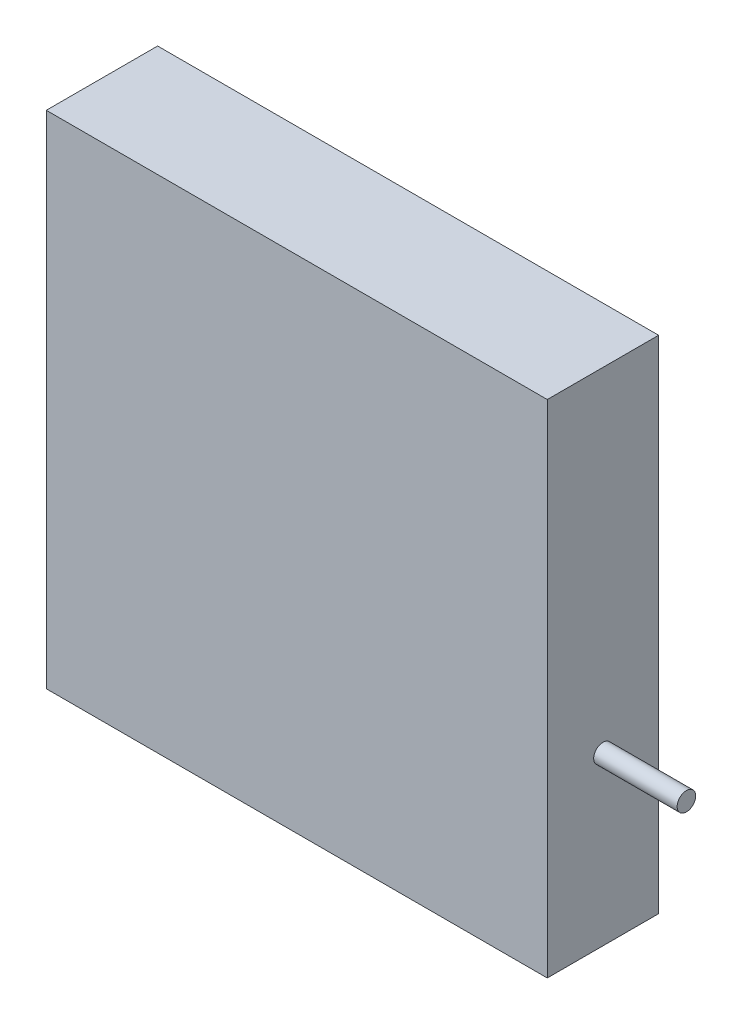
from build123d import *

# Parameters (mm, degrees)
SKETCH2_W           = 270
SKETCH2_H           = 270
BOSS_EXTRUDE1_DEPTH = 37.5
SKETCH3_W           = 270
SKETCH3_H           = 270
SKETCH3_W_2         = 195
SKETCH3_H_2         = 200
CUT_EXTRUDE1_DEPTH  = 15
SKETCH4_W           = 250
SKETCH4_H           = 250
SKETCH4_W_2         = 223
SKETCH4_H_2         = 228
CUT_EXTRUDE2_DEPTH  = 8
SKETCH5_R           = 5
BOSS_EXTRUDE2_DEPTH = 45


with BuildPart() as part:
    # Sketch2 → Boss-Extrude1 (new, symmetric)
    with BuildSketch(Plane.XY):
        Rectangle(SKETCH2_W, SKETCH2_H)
    extrude(amount=BOSS_EXTRUDE1_DEPTH, both=True)

    # Sketch3 → Cut-Extrude1 (cut)
    with BuildSketch(Plane(origin=(0, 0, -37.5), x_dir=(-1, 0, 0), z_dir=(0, 0, -1))):
        Rectangle(SKETCH3_W, SKETCH3_H)
        Rectangle(SKETCH3_W_2, SKETCH3_H_2, mode=Mode.SUBTRACT)
    extrude(amount=-CUT_EXTRUDE1_DEPTH, mode=Mode.SUBTRACT)

    # Sketch4 → Cut-Extrude2 (cut)
    with BuildSketch(Plane(origin=(0, 0, -22.5), x_dir=(-1, 0, 0), z_dir=(0, 0, -1))):
        Rectangle(SKETCH4_W, SKETCH4_H)
        Rectangle(SKETCH4_W_2, SKETCH4_H_2, mode=Mode.SUBTRACT)
    extrude(amount=-CUT_EXTRUDE2_DEPTH, mode=Mode.SUBTRACT)

    # Sketch5 → Boss-Extrude2 (add)
    with BuildSketch(Plane(origin=(135, 0, 0), x_dir=(0, 0, -1), z_dir=(1, 0, 0))):
        with Locations(Location((-7.5, -45, 0), (0, 0, 270))):
            Circle(SKETCH5_R)
    extrude(amount=BOSS_EXTRUDE2_DEPTH)


solid = part.part
